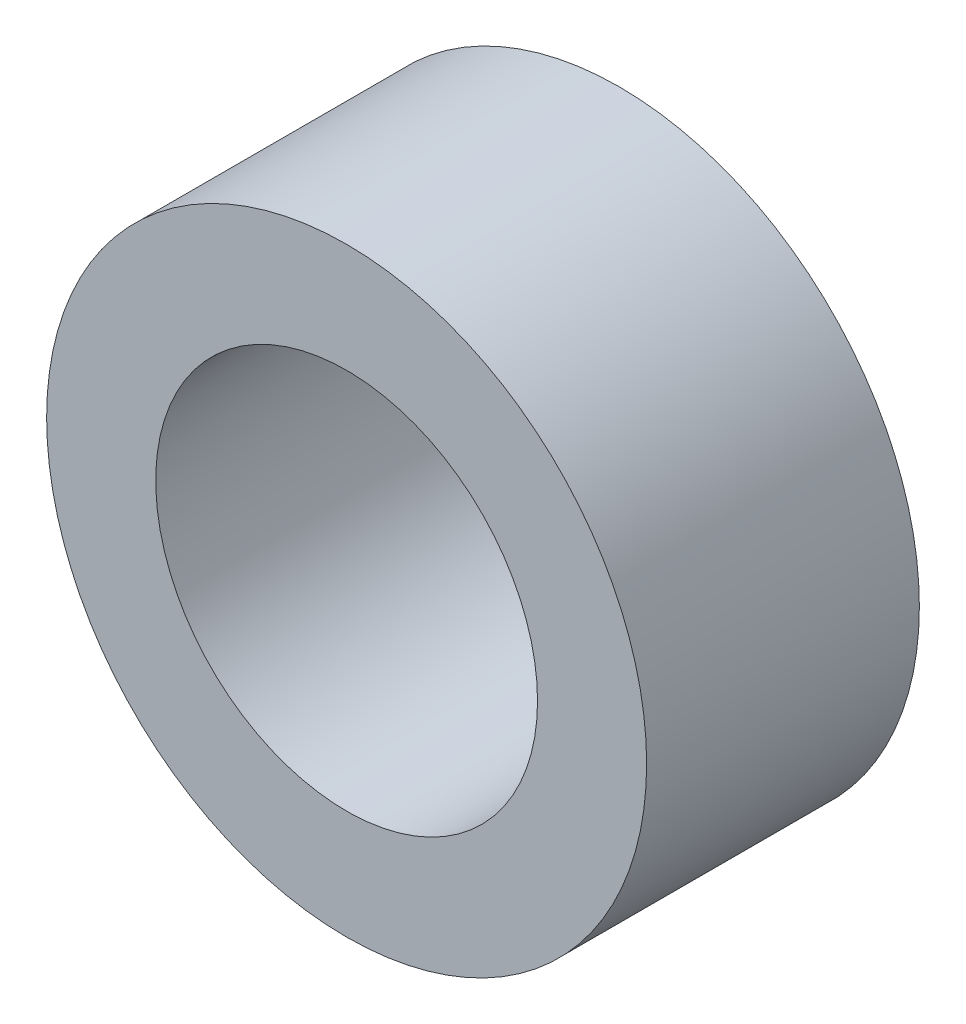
from build123d import *

# Parameters (mm, degrees)
SKETCH_1_R      = 2.75
SKETCH_1_R_2    = 1.75
EXTRUDE_1_DEPTH = 2.5


with BuildPart() as part:
    # Sketch 1 → Extrude 1 (new body)
    with BuildSketch(Plane.XY):
        Circle(SKETCH_1_R)
        Circle(SKETCH_1_R_2, mode=Mode.SUBTRACT)
    extrude(amount=EXTRUDE_1_DEPTH)


solid = part.part
